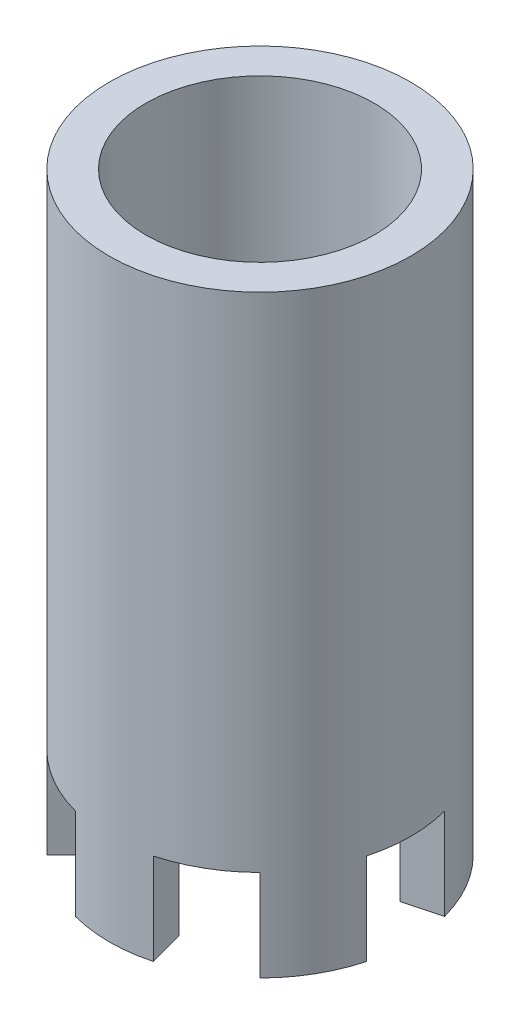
from build123d import *
from build123d.topology import SkipClean

# Parameters (mm, degrees)
SKETCH2_R           = 3.3
SKETCH2_R_2         = 2.5
BOSS_EXTRUDE1_DEPTH = 11
BOSS_EXTRUDE2_START = 2
BOSS_EXTRUDE2_DEPTH = 2


with BuildPart() as part:
    # Sketch2 → Boss-Extrude1 (new body)
    with BuildSketch(Plane(origin=(0, 0, 0), x_dir=(1, 0, 0), z_dir=(0, 1, 0))):
        with Locations(Location((0, 0, 0), (0, 0, 270))):
            Circle(SKETCH2_R)
        with Locations(Location((0, 0, 0), (0, 0, 270))):
            Circle(SKETCH2_R_2, mode=Mode.SUBTRACT)
    extrude(amount=BOSS_EXTRUDE1_DEPTH)

    # Sketch3 → Boss-Extrude2 (add)
    with SkipClean():  # the faces are left unmerged after this step: merging them gives an invalid solid
        with BuildSketch(Plane.XZ.offset(BOSS_EXTRUDE2_START)):
            with BuildLine():
                Line((-0.647047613, 2.414814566), (-0.854102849, 3.187555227))
                ThreePointArc((-0.854102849, 3.187555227), (0, 3.3), (0.854102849, 3.187555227))
                Line((0.854102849, 3.187555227), (0.647047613, 2.414814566))
                ThreePointArc((0.647047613, 2.414814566), (0, 2.5), (-0.647047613, 2.414814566))
            make_face()
            with BuildLine():
                Line((1.767766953, 1.767766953), (2.333452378, 2.333452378))
                ThreePointArc((2.333452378, 2.333452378), (2.857883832, 1.65), (3.187555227, 0.854102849))
                Line((3.187555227, 0.854102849), (2.414814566, 0.647047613))
                ThreePointArc((2.414814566, 0.647047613), (2.165063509, 1.25), (1.767766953, 1.767766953))
            make_face()
            with BuildLine():
                Line((2.414814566, -0.647047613), (3.187555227, -0.854102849))
                ThreePointArc((3.187555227, -0.854102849), (2.857883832, -1.65), (2.333452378, -2.333452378))
                Line((2.333452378, -2.333452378), (1.767766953, -1.767766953))
                ThreePointArc((1.767766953, -1.767766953), (2.165063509, -1.25), (2.414814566, -0.647047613))
            make_face()
            with BuildLine():
                Line((0.647047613, -2.414814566), (0.854102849, -3.187555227))
                ThreePointArc((0.854102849, -3.187555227), (0, -3.3), (-0.854102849, -3.187555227))
                Line((-0.854102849, -3.187555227), (-0.647047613, -2.414814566))
                ThreePointArc((-0.647047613, -2.414814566), (0, -2.5), (0.647047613, -2.414814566))
            make_face()
            with BuildLine():
                Line((-1.767766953, -1.767766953), (-2.333452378, -2.333452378))
                ThreePointArc((-2.333452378, -2.333452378), (-2.857883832, -1.65), (-3.187555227, -0.854102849))
                Line((-3.187555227, -0.854102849), (-2.414814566, -0.647047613))
                ThreePointArc((-2.414814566, -0.647047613), (-2.165063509, -1.25), (-1.767766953, -1.767766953))
            make_face()
            with BuildLine():
                Line((-2.414814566, 0.647047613), (-3.187555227, 0.854102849))
                ThreePointArc((-3.187555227, 0.854102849), (-2.857883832, 1.65), (-2.333452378, 2.333452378))
                Line((-2.333452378, 2.333452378), (-1.767766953, 1.767766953))
                ThreePointArc((-1.767766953, 1.767766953), (-2.165063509, 1.25), (-2.414814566, 0.647047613))
            make_face()
        extrude(amount=-BOSS_EXTRUDE2_DEPTH)


solid = part.part
